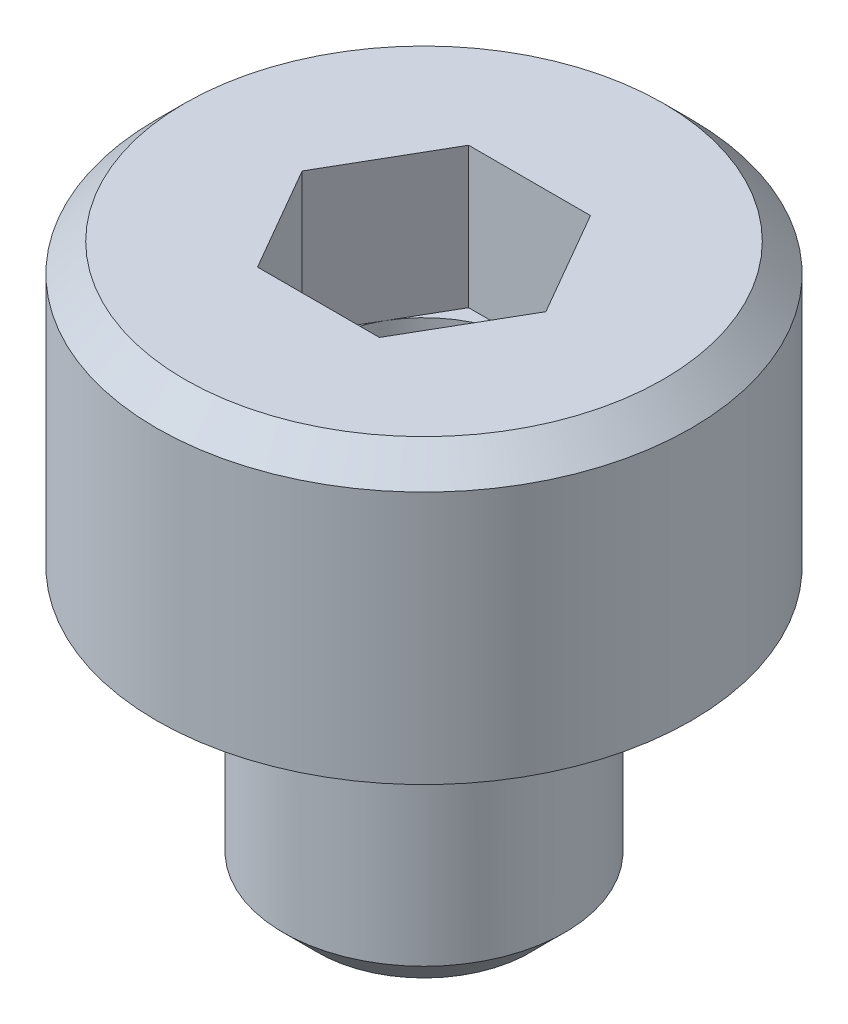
ISO-10303-21;
HEADER;
FILE_DESCRIPTION(('STEP AP214'),'2;1');
FILE_NAME('part.step','',(''),(''),'','','');
FILE_SCHEMA(('AUTOMOTIVE_DESIGN { 1 0 10303 214 1 1 1 1 }'));
ENDSEC;
DATA;
#1=APPLICATION_CONTEXT('core data for automotive mechanical design processes');
#2=APPLICATION_PROTOCOL_DEFINITION('international standard','automotive_design',2000,#1);
#3=PRODUCT_CONTEXT('',#1,'mechanical');
#4=PRODUCT('Part','Part','',(#3));
#5=PRODUCT_RELATED_PRODUCT_CATEGORY('part','',(#4));
#6=PRODUCT_DEFINITION_FORMATION('','',#4);
#7=PRODUCT_DEFINITION_CONTEXT('part definition',#1,'design');
#8=PRODUCT_DEFINITION('design','',#6,#7);
#9=PRODUCT_DEFINITION_SHAPE('','',#8);
#10=(LENGTH_UNIT() NAMED_UNIT(*) SI_UNIT(.MILLI.,.METRE.));
#11=(NAMED_UNIT(*) PLANE_ANGLE_UNIT() SI_UNIT($,.RADIAN.));
#12=(NAMED_UNIT(*) SI_UNIT($,.STERADIAN.) SOLID_ANGLE_UNIT());
#13=UNCERTAINTY_MEASURE_WITH_UNIT(LENGTH_MEASURE(1.E-05),#10,'distance_accuracy_value','');
#14=(GEOMETRIC_REPRESENTATION_CONTEXT(3) GLOBAL_UNCERTAINTY_ASSIGNED_CONTEXT((#13)) GLOBAL_UNIT_ASSIGNED_CONTEXT((#10,
#11,#12)) REPRESENTATION_CONTEXT('',''));
#15=CARTESIAN_POINT('',(0.,0.,0.));
#16=DIRECTION('',(0.,0.,1.));
#17=DIRECTION('',(1.,0.,0.));
#18=AXIS2_PLACEMENT_3D('',#15,#16,#17);
#19=CARTESIAN_POINT('',(0.,0.550000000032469,0.));
#20=DIRECTION('',(0.,1.,0.));
#21=DIRECTION('',(0.,0.,1.));
#22=AXIS2_PLACEMENT_3D('',#19,#20,#21);
#23=CONICAL_SURFACE('',#22,0.750000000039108,1.04719755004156);
#24=CARTESIAN_POINT('',(0.,0.116987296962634,0.));
#25=VERTEX_POINT('',#24);
#26=VERTEX_LOOP('',#25);
#27=FACE_BOUND('',#26,.T.);
#28=CARTESIAN_POINT('',(0.,0.55,0.));
#29=DIRECTION('',(0.,-1.,0.));
#30=DIRECTION('',(0.,0.,-1.));
#31=AXIS2_PLACEMENT_3D('',#28,#29,#30);
#32=CIRCLE('',#31,0.75);
#33=CARTESIAN_POINT('',(0.,0.55,-0.75));
#34=VERTEX_POINT('',#33);
#35=EDGE_CURVE('E98',#34,#34,#32,.F.);
#36=ORIENTED_EDGE('',*,*,#35,.T.);
#37=EDGE_LOOP('',(#36));
#38=FACE_BOUND('',#37,.T.);
#39=ADVANCED_FACE('F16',(#27,#38),#23,.F.);
#40=CARTESIAN_POINT('',(0.,2.,0.));
#41=DIRECTION('',(0.,-1.,0.));
#42=DIRECTION('',(0.,0.,-1.));
#43=AXIS2_PLACEMENT_3D('',#40,#41,#42);
#44=CYLINDRICAL_SURFACE('',#43,0.75);
#45=CARTESIAN_POINT('',(0.,1.,0.));
#46=DIRECTION('',(0.,-1.,0.));
#47=DIRECTION('',(0.,0.,-1.));
#48=AXIS2_PLACEMENT_3D('',#45,#46,#47);
#49=CIRCLE('',#48,0.75);
#50=CARTESIAN_POINT('',(0.,1.,-0.75));
#51=VERTEX_POINT('',#50);
#52=CARTESIAN_POINT('',(-0.649519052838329,1.,-0.375));
#53=VERTEX_POINT('',#52);
#54=EDGE_CURVE('E19',#51,#53,#49,.F.);
#55=ORIENTED_EDGE('',*,*,#54,.T.);
#56=CARTESIAN_POINT('',(0.,1.,0.));
#57=DIRECTION('',(0.,-1.,0.));
#58=DIRECTION('',(0.,0.,-1.));
#59=AXIS2_PLACEMENT_3D('',#56,#57,#58);
#60=CIRCLE('',#59,0.75);
#61=CARTESIAN_POINT('',(-0.649519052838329,1.,0.375));
#62=VERTEX_POINT('',#61);
#63=EDGE_CURVE('E93',#53,#62,#60,.F.);
#64=ORIENTED_EDGE('',*,*,#63,.T.);
#65=CARTESIAN_POINT('',(0.,1.,0.));
#66=DIRECTION('',(0.,-1.,0.));
#67=DIRECTION('',(0.,0.,-1.));
#68=AXIS2_PLACEMENT_3D('',#65,#66,#67);
#69=CIRCLE('',#68,0.75);
#70=CARTESIAN_POINT('',(0.,1.,0.75));
#71=VERTEX_POINT('',#70);
#72=EDGE_CURVE('E109',#62,#71,#69,.F.);
#73=ORIENTED_EDGE('',*,*,#72,.T.);
#74=CARTESIAN_POINT('',(0.,1.,0.));
#75=DIRECTION('',(0.,-1.,0.));
#76=DIRECTION('',(0.,0.,-1.));
#77=AXIS2_PLACEMENT_3D('',#74,#75,#76);
#78=CIRCLE('',#77,0.75);
#79=CARTESIAN_POINT('',(0.649519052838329,1.,0.375));
#80=VERTEX_POINT('',#79);
#81=EDGE_CURVE('E215',#71,#80,#78,.F.);
#82=ORIENTED_EDGE('',*,*,#81,.T.);
#83=CARTESIAN_POINT('',(0.,1.,0.));
#84=DIRECTION('',(0.,-1.,0.));
#85=DIRECTION('',(0.,0.,-1.));
#86=AXIS2_PLACEMENT_3D('',#83,#84,#85);
#87=CIRCLE('',#86,0.75);
#88=CARTESIAN_POINT('',(0.649519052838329,1.,-0.375));
#89=VERTEX_POINT('',#88);
#90=EDGE_CURVE('E217',#80,#89,#87,.F.);
#91=ORIENTED_EDGE('',*,*,#90,.T.);
#92=CARTESIAN_POINT('',(0.,1.,0.));
#93=DIRECTION('',(0.,-1.,0.));
#94=DIRECTION('',(0.,0.,-1.));
#95=AXIS2_PLACEMENT_3D('',#92,#93,#94);
#96=CIRCLE('',#95,0.75);
#97=EDGE_CURVE('E88',#89,#51,#96,.F.);
#98=ORIENTED_EDGE('',*,*,#97,.T.);
#99=EDGE_LOOP('',(#55,#64,#73,#82,#91,#98));
#100=FACE_BOUND('',#99,.T.);
#101=ORIENTED_EDGE('',*,*,#35,.F.);
#102=EDGE_LOOP('',(#101));
#103=FACE_BOUND('',#102,.T.);
#104=ADVANCED_FACE('F91',(#100,#103),#44,.F.);
#105=CARTESIAN_POINT('',(0.,-2.,0.));
#106=DIRECTION('',(0.,-1.,0.));
#107=DIRECTION('',(0.,0.,-1.));
#108=AXIS2_PLACEMENT_3D('',#105,#106,#107);
#109=PLANE('',#108);
#110=CARTESIAN_POINT('',(0.,-2.00000000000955,0.));
#111=DIRECTION('',(0.,1.,0.));
#112=DIRECTION('',(-1.,0.,0.));
#113=AXIS2_PLACEMENT_3D('',#110,#111,#112);
#114=CIRCLE('',#113,0.754620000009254);
#115=CARTESIAN_POINT('',(-0.754620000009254,-2.00000000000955,0.));
#116=VERTEX_POINT('',#115);
#117=EDGE_CURVE('E108',#116,#116,#114,.T.);
#118=ORIENTED_EDGE('',*,*,#117,.F.);
#119=EDGE_LOOP('',(#118));
#120=FACE_BOUND('',#119,.T.);
#121=ADVANCED_FACE('F430',(#120),#109,.T.);
#122=CARTESIAN_POINT('',(0.,1.,0.));
#123=DIRECTION('',(0.,-1.,0.));
#124=DIRECTION('',(0.,0.,-1.));
#125=AXIS2_PLACEMENT_3D('',#122,#123,#124);
#126=PLANE('',#125);
#127=DIRECTION('',(-0.5,0.,0.866025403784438));
#128=VECTOR('',#127,1.);
#129=CARTESIAN_POINT('',(-0.649519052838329,1.,-0.375));
#130=LINE('',#129,#128);
#131=CARTESIAN_POINT('',(-0.433012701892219,1.,-0.75));
#132=VERTEX_POINT('',#131);
#133=EDGE_CURVE('E112',#132,#53,#130,.T.);
#134=ORIENTED_EDGE('',*,*,#133,.T.);
#135=ORIENTED_EDGE('',*,*,#54,.F.);
#136=DIRECTION('',(-1.,0.,0.));
#137=VECTOR('',#136,1.);
#138=CARTESIAN_POINT('',(0.,1.,-0.75));
#139=LINE('',#138,#137);
#140=EDGE_CURVE('E115',#51,#132,#139,.T.);
#141=ORIENTED_EDGE('',*,*,#140,.T.);
#142=EDGE_LOOP('',(#134,#135,#141));
#143=FACE_BOUND('',#142,.T.);
#144=ADVANCED_FACE('F113',(#143),#126,.F.);
#145=CARTESIAN_POINT('',(0.,1.,0.));
#146=DIRECTION('',(0.,-1.,0.));
#147=DIRECTION('',(0.,0.,-1.));
#148=AXIS2_PLACEMENT_3D('',#145,#146,#147);
#149=PLANE('',#148);
#150=DIRECTION('',(-1.,0.,0.));
#151=VECTOR('',#150,1.);
#152=CARTESIAN_POINT('',(0.,1.,-0.75));
#153=LINE('',#152,#151);
#154=CARTESIAN_POINT('',(0.43301270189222,1.,-0.75));
#155=VERTEX_POINT('',#154);
#156=EDGE_CURVE('E187',#155,#51,#153,.T.);
#157=ORIENTED_EDGE('',*,*,#156,.T.);
#158=ORIENTED_EDGE('',*,*,#97,.F.);
#159=DIRECTION('',(0.5,0.,0.866025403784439));
#160=VECTOR('',#159,1.);
#161=CARTESIAN_POINT('',(0.649519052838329,1.,-0.375));
#162=LINE('',#161,#160);
#163=EDGE_CURVE('E178',#155,#89,#162,.T.);
#164=ORIENTED_EDGE('',*,*,#163,.F.);
#165=EDGE_LOOP('',(#157,#158,#164));
#166=FACE_BOUND('',#165,.T.);
#167=ADVANCED_FACE('F224',(#166),#149,.F.);
#168=CARTESIAN_POINT('',(0.,1.,0.));
#169=DIRECTION('',(0.,-1.,0.));
#170=DIRECTION('',(0.,0.,-1.));
#171=AXIS2_PLACEMENT_3D('',#168,#169,#170);
#172=PLANE('',#171);
#173=DIRECTION('',(0.5,0.,0.866025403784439));
#174=VECTOR('',#173,1.);
#175=CARTESIAN_POINT('',(0.649519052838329,1.,-0.375));
#176=LINE('',#175,#174);
#177=CARTESIAN_POINT('',(0.866025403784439,1.,0.));
#178=VERTEX_POINT('',#177);
#179=EDGE_CURVE('E175',#89,#178,#176,.T.);
#180=ORIENTED_EDGE('',*,*,#179,.F.);
#181=ORIENTED_EDGE('',*,*,#90,.F.);
#182=DIRECTION('',(-0.5,0.,0.866025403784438));
#183=VECTOR('',#182,1.);
#184=CARTESIAN_POINT('',(0.649519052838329,1.,0.375));
#185=LINE('',#184,#183);
#186=EDGE_CURVE('E163',#178,#80,#185,.T.);
#187=ORIENTED_EDGE('',*,*,#186,.F.);
#188=EDGE_LOOP('',(#180,#181,#187));
#189=FACE_BOUND('',#188,.T.);
#190=ADVANCED_FACE('F226',(#189),#172,.F.);
#191=CARTESIAN_POINT('',(0.,1.,0.));
#192=DIRECTION('',(0.,-1.,0.));
#193=DIRECTION('',(0.,0.,-1.));
#194=AXIS2_PLACEMENT_3D('',#191,#192,#193);
#195=PLANE('',#194);
#196=DIRECTION('',(-0.5,0.,0.866025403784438));
#197=VECTOR('',#196,1.);
#198=CARTESIAN_POINT('',(0.649519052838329,1.,0.375));
#199=LINE('',#198,#197);
#200=CARTESIAN_POINT('',(0.433012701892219,1.,0.75));
#201=VERTEX_POINT('',#200);
#202=EDGE_CURVE('E160',#80,#201,#199,.T.);
#203=ORIENTED_EDGE('',*,*,#202,.F.);
#204=ORIENTED_EDGE('',*,*,#81,.F.);
#205=DIRECTION('',(-1.,0.,0.));
#206=VECTOR('',#205,1.);
#207=CARTESIAN_POINT('',(0.,1.,0.75));
#208=LINE('',#207,#206);
#209=EDGE_CURVE('E148',#201,#71,#208,.T.);
#210=ORIENTED_EDGE('',*,*,#209,.F.);
#211=EDGE_LOOP('',(#203,#204,#210));
#212=FACE_BOUND('',#211,.T.);
#213=ADVANCED_FACE('F269',(#212),#195,.F.);
#214=CARTESIAN_POINT('',(0.,1.,0.));
#215=DIRECTION('',(0.,-1.,0.));
#216=DIRECTION('',(0.,0.,-1.));
#217=AXIS2_PLACEMENT_3D('',#214,#215,#216);
#218=PLANE('',#217);
#219=DIRECTION('',(-1.,0.,0.));
#220=VECTOR('',#219,1.);
#221=CARTESIAN_POINT('',(0.,1.,0.75));
#222=LINE('',#221,#220);
#223=CARTESIAN_POINT('',(-0.433012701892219,1.,0.75));
#224=VERTEX_POINT('',#223);
#225=EDGE_CURVE('E145',#71,#224,#222,.T.);
#226=ORIENTED_EDGE('',*,*,#225,.F.);
#227=ORIENTED_EDGE('',*,*,#72,.F.);
#228=DIRECTION('',(0.5,0.,0.866025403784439));
#229=VECTOR('',#228,1.);
#230=CARTESIAN_POINT('',(-0.649519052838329,1.,0.375));
#231=LINE('',#230,#229);
#232=EDGE_CURVE('E152',#62,#224,#231,.T.);
#233=ORIENTED_EDGE('',*,*,#232,.T.);
#234=EDGE_LOOP('',(#226,#227,#233));
#235=FACE_BOUND('',#234,.T.);
#236=ADVANCED_FACE('F266',(#235),#218,.F.);
#237=CARTESIAN_POINT('',(0.,1.,0.));
#238=DIRECTION('',(0.,-1.,0.));
#239=DIRECTION('',(0.,0.,-1.));
#240=AXIS2_PLACEMENT_3D('',#237,#238,#239);
#241=PLANE('',#240);
#242=DIRECTION('',(0.5,0.,0.866025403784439));
#243=VECTOR('',#242,1.);
#244=CARTESIAN_POINT('',(-0.649519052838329,1.,0.375));
#245=LINE('',#244,#243);
#246=CARTESIAN_POINT('',(-0.866025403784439,1.,0.));
#247=VERTEX_POINT('',#246);
#248=EDGE_CURVE('E106',#247,#62,#245,.T.);
#249=ORIENTED_EDGE('',*,*,#248,.T.);
#250=ORIENTED_EDGE('',*,*,#63,.F.);
#251=DIRECTION('',(-0.5,0.,0.866025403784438));
#252=VECTOR('',#251,1.);
#253=CARTESIAN_POINT('',(-0.649519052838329,1.,-0.375));
#254=LINE('',#253,#252);
#255=EDGE_CURVE('E103',#53,#247,#254,.T.);
#256=ORIENTED_EDGE('',*,*,#255,.T.);
#257=EDGE_LOOP('',(#249,#250,#256));
#258=FACE_BOUND('',#257,.T.);
#259=ADVANCED_FACE('F101',(#258),#241,.F.);
#260=CARTESIAN_POINT('',(0.,-1.75461999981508,0.));
#261=DIRECTION('',(0.,1.,0.));
#262=DIRECTION('',(-1.,0.,0.));
#263=AXIS2_PLACEMENT_3D('',#260,#261,#262);
#264=CONICAL_SURFACE('',#263,0.999999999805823,0.785398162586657);
#265=ORIENTED_EDGE('',*,*,#117,.T.);
#266=EDGE_LOOP('',(#265));
#267=FACE_BOUND('',#266,.T.);
#268=CARTESIAN_POINT('',(0.,-1.75462,0.));
#269=DIRECTION('',(0.,-1.,0.));
#270=DIRECTION('',(0.,0.,-1.));
#271=AXIS2_PLACEMENT_3D('',#268,#269,#270);
#272=CIRCLE('',#271,1.);
#273=CARTESIAN_POINT('',(0.,-1.75462,-1.));
#274=VERTEX_POINT('',#273);
#275=EDGE_CURVE('E135',#274,#274,#272,.F.);
#276=ORIENTED_EDGE('',*,*,#275,.F.);
#277=EDGE_LOOP('',(#276));
#278=FACE_BOUND('',#277,.T.);
#279=ADVANCED_FACE('F386',(#267,#278),#264,.T.);
#280=CARTESIAN_POINT('',(-0.649519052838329,1.5,-0.375));
#281=DIRECTION('',(-0.866025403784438,0.,-0.5));
#282=DIRECTION('',(-0.5,0.,0.866025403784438));
#283=AXIS2_PLACEMENT_3D('',#280,#281,#282);
#284=PLANE('',#283);
#285=DIRECTION('',(0.,1.,0.));
#286=VECTOR('',#285,1.);
#287=CARTESIAN_POINT('',(-0.433012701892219,2.,-0.75));
#288=LINE('',#287,#286);
#289=CARTESIAN_POINT('',(-0.433012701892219,2.,-0.75));
#290=VERTEX_POINT('',#289);
#291=EDGE_CURVE('E191',#132,#290,#288,.T.);
#292=ORIENTED_EDGE('',*,*,#291,.T.);
#293=DIRECTION('',(0.500000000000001,0.,-0.866025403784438));
#294=VECTOR('',#293,1.);
#295=CARTESIAN_POINT('',(-0.866025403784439,2.,0.));
#296=LINE('',#295,#294);
#297=CARTESIAN_POINT('',(-0.866025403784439,2.,0.));
#298=VERTEX_POINT('',#297);
#299=EDGE_CURVE('E131',#298,#290,#296,.T.);
#300=ORIENTED_EDGE('',*,*,#299,.F.);
#301=DIRECTION('',(0.,1.,0.));
#302=VECTOR('',#301,1.);
#303=CARTESIAN_POINT('',(-0.866025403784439,1.5,0.));
#304=LINE('',#303,#302);
#305=EDGE_CURVE('E121',#298,#247,#304,.F.);
#306=ORIENTED_EDGE('',*,*,#305,.T.);
#307=ORIENTED_EDGE('',*,*,#255,.F.);
#308=ORIENTED_EDGE('',*,*,#133,.F.);
#309=EDGE_LOOP('',(#292,#300,#306,#307,#308));
#310=FACE_BOUND('',#309,.T.);
#311=ADVANCED_FACE('F119',(#310),#284,.F.);
#312=CARTESIAN_POINT('',(0.,2.,-0.75));
#313=DIRECTION('',(0.,0.,-1.));
#314=DIRECTION('',(-1.,0.,0.));
#315=AXIS2_PLACEMENT_3D('',#312,#313,#314);
#316=PLANE('',#315);
#317=DIRECTION('',(0.,1.,0.));
#318=VECTOR('',#317,1.);
#319=CARTESIAN_POINT('',(0.43301270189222,1.5,-0.75));
#320=LINE('',#319,#318);
#321=CARTESIAN_POINT('',(0.43301270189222,2.,-0.75));
#322=VERTEX_POINT('',#321);
#323=EDGE_CURVE('E172',#322,#155,#320,.F.);
#324=ORIENTED_EDGE('',*,*,#323,.F.);
#325=DIRECTION('',(1.,0.,0.));
#326=VECTOR('',#325,1.);
#327=CARTESIAN_POINT('',(0.,2.,-0.75));
#328=LINE('',#327,#326);
#329=EDGE_CURVE('E134',#290,#322,#328,.T.);
#330=ORIENTED_EDGE('',*,*,#329,.F.);
#331=ORIENTED_EDGE('',*,*,#291,.F.);
#332=ORIENTED_EDGE('',*,*,#140,.F.);
#333=ORIENTED_EDGE('',*,*,#156,.F.);
#334=EDGE_LOOP('',(#324,#330,#331,#332,#333));
#335=FACE_BOUND('',#334,.T.);
#336=ADVANCED_FACE('F235',(#335),#316,.F.);
#337=CARTESIAN_POINT('',(0.649519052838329,1.5,-0.375));
#338=DIRECTION('',(-0.866025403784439,0.,0.5));
#339=DIRECTION('',(0.5,0.,0.866025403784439));
#340=AXIS2_PLACEMENT_3D('',#337,#338,#339);
#341=PLANE('',#340);
#342=DIRECTION('',(0.5,0.,0.866025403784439));
#343=VECTOR('',#342,1.);
#344=CARTESIAN_POINT('',(0.43301270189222,2.,-0.75));
#345=LINE('',#344,#343);
#346=CARTESIAN_POINT('',(0.866025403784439,2.,0.));
#347=VERTEX_POINT('',#346);
#348=EDGE_CURVE('E231',#322,#347,#345,.T.);
#349=ORIENTED_EDGE('',*,*,#348,.F.);
#350=ORIENTED_EDGE('',*,*,#323,.T.);
#351=ORIENTED_EDGE('',*,*,#163,.T.);
#352=ORIENTED_EDGE('',*,*,#179,.T.);
#353=DIRECTION('',(0.,1.,0.));
#354=VECTOR('',#353,1.);
#355=CARTESIAN_POINT('',(0.866025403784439,1.5,0.));
#356=LINE('',#355,#354);
#357=EDGE_CURVE('E157',#347,#178,#356,.F.);
#358=ORIENTED_EDGE('',*,*,#357,.F.);
#359=EDGE_LOOP('',(#349,#350,#351,#352,#358));
#360=FACE_BOUND('',#359,.T.);
#361=ADVANCED_FACE('F229',(#360),#341,.T.);
#362=CARTESIAN_POINT('',(0.649519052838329,1.5,0.375));
#363=DIRECTION('',(-0.866025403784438,0.,-0.5));
#364=DIRECTION('',(-0.5,0.,0.866025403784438));
#365=AXIS2_PLACEMENT_3D('',#362,#363,#364);
#366=PLANE('',#365);
#367=DIRECTION('',(-0.500000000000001,0.,0.866025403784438));
#368=VECTOR('',#367,1.);
#369=CARTESIAN_POINT('',(0.866025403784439,2.,0.));
#370=LINE('',#369,#368);
#371=CARTESIAN_POINT('',(0.433012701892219,2.,0.75));
#372=VERTEX_POINT('',#371);
#373=EDGE_CURVE('E244',#347,#372,#370,.T.);
#374=ORIENTED_EDGE('',*,*,#373,.F.);
#375=ORIENTED_EDGE('',*,*,#357,.T.);
#376=ORIENTED_EDGE('',*,*,#186,.T.);
#377=ORIENTED_EDGE('',*,*,#202,.T.);
#378=DIRECTION('',(0.,1.,0.));
#379=VECTOR('',#378,1.);
#380=CARTESIAN_POINT('',(0.433012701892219,2.,0.75));
#381=LINE('',#380,#379);
#382=EDGE_CURVE('E147',#372,#201,#381,.F.);
#383=ORIENTED_EDGE('',*,*,#382,.F.);
#384=EDGE_LOOP('',(#374,#375,#376,#377,#383));
#385=FACE_BOUND('',#384,.T.);
#386=ADVANCED_FACE('F271',(#385),#366,.T.);
#387=CARTESIAN_POINT('',(0.,2.,0.75));
#388=DIRECTION('',(0.,0.,-1.));
#389=DIRECTION('',(-1.,0.,0.));
#390=AXIS2_PLACEMENT_3D('',#387,#388,#389);
#391=PLANE('',#390);
#392=DIRECTION('',(1.,0.,0.));
#393=VECTOR('',#392,1.);
#394=CARTESIAN_POINT('',(0.,2.,0.75));
#395=LINE('',#394,#393);
#396=CARTESIAN_POINT('',(-0.433012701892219,2.,0.75));
#397=VERTEX_POINT('',#396);
#398=EDGE_CURVE('E142',#372,#397,#395,.F.);
#399=ORIENTED_EDGE('',*,*,#398,.F.);
#400=ORIENTED_EDGE('',*,*,#382,.T.);
#401=ORIENTED_EDGE('',*,*,#209,.T.);
#402=ORIENTED_EDGE('',*,*,#225,.T.);
#403=DIRECTION('',(0.,1.,0.));
#404=VECTOR('',#403,1.);
#405=CARTESIAN_POINT('',(-0.433012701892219,1.5,0.75));
#406=LINE('',#405,#404);
#407=EDGE_CURVE('E34',#224,#397,#406,.T.);
#408=ORIENTED_EDGE('',*,*,#407,.T.);
#409=EDGE_LOOP('',(#399,#400,#401,#402,#408));
#410=FACE_BOUND('',#409,.T.);
#411=ADVANCED_FACE('F267',(#410),#391,.T.);
#412=CARTESIAN_POINT('',(-0.649519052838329,1.5,0.375));
#413=DIRECTION('',(-0.866025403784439,0.,0.5));
#414=DIRECTION('',(0.5,0.,0.866025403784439));
#415=AXIS2_PLACEMENT_3D('',#412,#413,#414);
#416=PLANE('',#415);
#417=ORIENTED_EDGE('',*,*,#305,.F.);
#418=DIRECTION('',(-0.500000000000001,0.,-0.866025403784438));
#419=VECTOR('',#418,1.);
#420=CARTESIAN_POINT('',(-0.433012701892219,2.,0.75));
#421=LINE('',#420,#419);
#422=EDGE_CURVE('E138',#397,#298,#421,.T.);
#423=ORIENTED_EDGE('',*,*,#422,.F.);
#424=ORIENTED_EDGE('',*,*,#407,.F.);
#425=ORIENTED_EDGE('',*,*,#232,.F.);
#426=ORIENTED_EDGE('',*,*,#248,.F.);
#427=EDGE_LOOP('',(#417,#423,#424,#425,#426));
#428=FACE_BOUND('',#427,.T.);
#429=ADVANCED_FACE('F238',(#428),#416,.F.);
#430=CARTESIAN_POINT('',(0.,0.,0.));
#431=DIRECTION('',(0.,-1.,0.));
#432=DIRECTION('',(0.,0.,-1.));
#433=AXIS2_PLACEMENT_3D('',#430,#431,#432);
#434=CYLINDRICAL_SURFACE('',#433,1.);
#435=CARTESIAN_POINT('',(0.,-0.1,0.));
#436=DIRECTION('',(0.,-1.,0.));
#437=DIRECTION('',(0.,0.,1.));
#438=AXIS2_PLACEMENT_3D('',#435,#436,#437);
#439=CIRCLE('',#438,1.);
#440=CARTESIAN_POINT('',(0.,-0.1,1.));
#441=VERTEX_POINT('',#440);
#442=EDGE_CURVE('E141',#441,#441,#439,.T.);
#443=ORIENTED_EDGE('',*,*,#442,.T.);
#444=EDGE_LOOP('',(#443));
#445=FACE_BOUND('',#444,.T.);
#446=ORIENTED_EDGE('',*,*,#275,.T.);
#447=EDGE_LOOP('',(#446));
#448=FACE_BOUND('',#447,.T.);
#449=ADVANCED_FACE('F317',(#445,#448),#434,.T.);
#450=CARTESIAN_POINT('',(0.,2.,0.));
#451=DIRECTION('',(0.,1.,0.));
#452=DIRECTION('',(0.,0.,1.));
#453=AXIS2_PLACEMENT_3D('',#450,#451,#452);
#454=PLANE('',#453);
#455=ORIENTED_EDGE('',*,*,#398,.T.);
#456=ORIENTED_EDGE('',*,*,#422,.T.);
#457=ORIENTED_EDGE('',*,*,#299,.T.);
#458=ORIENTED_EDGE('',*,*,#329,.T.);
#459=ORIENTED_EDGE('',*,*,#348,.T.);
#460=ORIENTED_EDGE('',*,*,#373,.T.);
#461=EDGE_LOOP('',(#455,#456,#457,#458,#459,#460));
#462=FACE_BOUND('',#461,.T.);
#463=CARTESIAN_POINT('',(0.,2.00000000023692,0.));
#464=DIRECTION('',(0.,-1.,0.));
#465=DIRECTION('',(0.,0.,-1.));
#466=AXIS2_PLACEMENT_3D('',#463,#464,#465);
#467=CIRCLE('',#466,1.7000000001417);
#468=CARTESIAN_POINT('',(0.,2.00000000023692,-1.7000000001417));
#469=VERTEX_POINT('',#468);
#470=EDGE_CURVE('E210',#469,#469,#467,.T.);
#471=ORIENTED_EDGE('',*,*,#470,.F.);
#472=EDGE_LOOP('',(#471));
#473=FACE_BOUND('',#472,.T.);
#474=ADVANCED_FACE('F240',(#462,#473),#454,.T.);
#475=CARTESIAN_POINT('',(0.,-0.1,0.));
#476=DIRECTION('',(0.,-1.,0.));
#477=DIRECTION('',(0.,0.,1.));
#478=AXIS2_PLACEMENT_3D('',#475,#476,#477);
#479=TOROIDAL_SURFACE('',#478,1.1,0.1);
#480=ORIENTED_EDGE('',*,*,#442,.F.);
#481=EDGE_LOOP('',(#480));
#482=FACE_BOUND('',#481,.T.);
#483=CARTESIAN_POINT('',(0.,0.,0.));
#484=DIRECTION('',(0.,-1.,0.));
#485=DIRECTION('',(0.,0.,-1.));
#486=AXIS2_PLACEMENT_3D('',#483,#484,#485);
#487=CIRCLE('',#486,1.1);
#488=CARTESIAN_POINT('',(0.,0.,-1.1));
#489=VERTEX_POINT('',#488);
#490=EDGE_CURVE('E212',#489,#489,#487,.F.);
#491=ORIENTED_EDGE('',*,*,#490,.F.);
#492=EDGE_LOOP('',(#491));
#493=FACE_BOUND('',#492,.T.);
#494=ADVANCED_FACE('F310',(#482,#493),#479,.F.);
#495=CARTESIAN_POINT('',(0.,1.80000000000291,0.));
#496=DIRECTION('',(0.,-1.,0.));
#497=DIRECTION('',(0.,0.,-1.));
#498=AXIS2_PLACEMENT_3D('',#495,#496,#497);
#499=CONICAL_SURFACE('',#498,1.90000000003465,0.785398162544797);
#500=CARTESIAN_POINT('',(0.,1.8,0.));
#501=DIRECTION('',(0.,1.,0.));
#502=DIRECTION('',(0.,0.,1.));
#503=AXIS2_PLACEMENT_3D('',#500,#501,#502);
#504=CIRCLE('',#503,1.9);
#505=CARTESIAN_POINT('',(0.,1.8,1.9));
#506=VERTEX_POINT('',#505);
#507=EDGE_CURVE('E25',#506,#506,#504,.F.);
#508=ORIENTED_EDGE('',*,*,#507,.F.);
#509=EDGE_LOOP('',(#508));
#510=FACE_BOUND('',#509,.T.);
#511=ORIENTED_EDGE('',*,*,#470,.T.);
#512=EDGE_LOOP('',(#511));
#513=FACE_BOUND('',#512,.T.);
#514=ADVANCED_FACE('F289',(#510,#513),#499,.T.);
#515=CARTESIAN_POINT('',(0.,0.,0.));
#516=DIRECTION('',(0.,-1.,0.));
#517=DIRECTION('',(0.,0.,-1.));
#518=AXIS2_PLACEMENT_3D('',#515,#516,#517);
#519=PLANE('',#518);
#520=CARTESIAN_POINT('',(0.,0.,0.));
#521=DIRECTION('',(0.,1.,0.));
#522=DIRECTION('',(0.,0.,1.));
#523=AXIS2_PLACEMENT_3D('',#520,#521,#522);
#524=CIRCLE('',#523,1.9);
#525=CARTESIAN_POINT('',(0.,0.,1.9));
#526=VERTEX_POINT('',#525);
#527=EDGE_CURVE('E11',#526,#526,#524,.T.);
#528=ORIENTED_EDGE('',*,*,#527,.F.);
#529=EDGE_LOOP('',(#528));
#530=FACE_BOUND('',#529,.T.);
#531=ORIENTED_EDGE('',*,*,#490,.T.);
#532=EDGE_LOOP('',(#531));
#533=FACE_BOUND('',#532,.T.);
#534=ADVANCED_FACE('F283',(#530,#533),#519,.T.);
#535=CARTESIAN_POINT('',(0.,0.,0.));
#536=DIRECTION('',(0.,1.,0.));
#537=DIRECTION('',(0.,0.,1.));
#538=AXIS2_PLACEMENT_3D('',#535,#536,#537);
#539=CYLINDRICAL_SURFACE('',#538,1.9);
#540=ORIENTED_EDGE('',*,*,#527,.T.);
#541=EDGE_LOOP('',(#540));
#542=FACE_BOUND('',#541,.T.);
#543=ORIENTED_EDGE('',*,*,#507,.T.);
#544=EDGE_LOOP('',(#543));
#545=FACE_BOUND('',#544,.T.);
#546=ADVANCED_FACE('F281',(#542,#545),#539,.T.);
#547=CLOSED_SHELL('',(#39,#104,#121,#144,#167,#190,#213,#236,#259,#279,#311,#336,#361,#386,#411,
#429,#449,#474,#494,#514,#534,#546));
#548=MANIFOLD_SOLID_BREP('B1',#547);
#549=ADVANCED_BREP_SHAPE_REPRESENTATION('',(#18,#548),#14);
#550=SHAPE_DEFINITION_REPRESENTATION(#9,#549);
ENDSEC;
END-ISO-10303-21;
